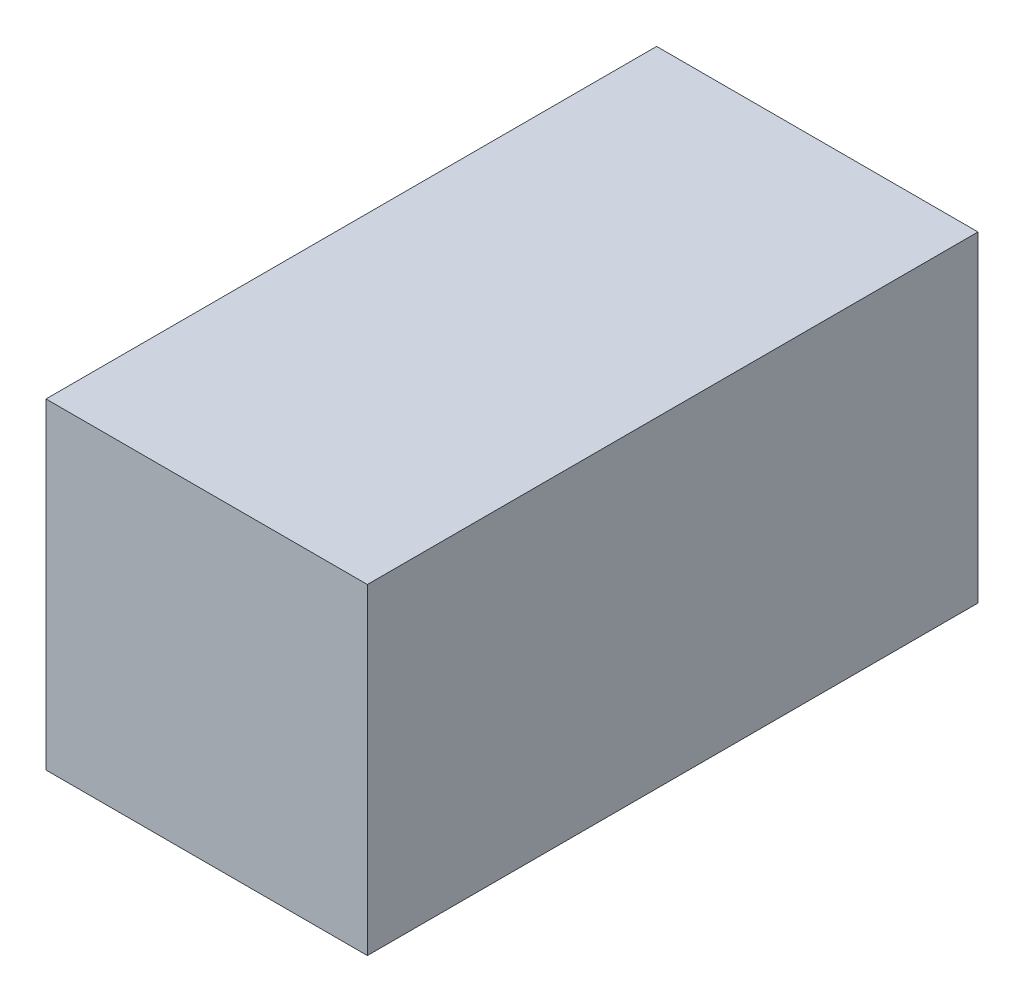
from build123d import *

# Parameters (mm, degrees)
SKETCH1_W           = 50
SKETCH1_H           = 50
BOSS_EXTRUDE1_DEPTH = 95


with BuildPart() as part:
    # Sketch1 → Boss-Extrude1 (new body)
    with BuildSketch(Plane.XY):
        with Locations((25, 25)):
            Rectangle(SKETCH1_W, SKETCH1_H)
    extrude(amount=BOSS_EXTRUDE1_DEPTH)


solid = part.part
